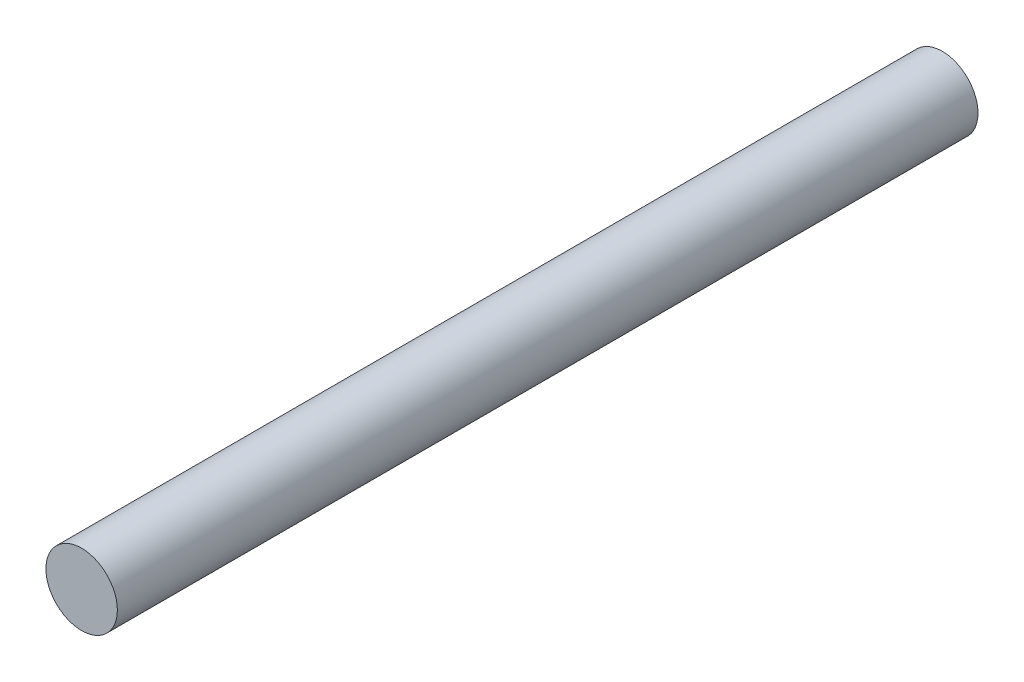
ISO-10303-21;
HEADER;
FILE_DESCRIPTION(('STEP AP214'),'2;1');
FILE_NAME('part.step','',(''),(''),'','','');
FILE_SCHEMA(('AUTOMOTIVE_DESIGN { 1 0 10303 214 1 1 1 1 }'));
ENDSEC;
DATA;
#1=APPLICATION_CONTEXT('core data for automotive mechanical design processes');
#2=APPLICATION_PROTOCOL_DEFINITION('international standard','automotive_design',2000,#1);
#3=PRODUCT_CONTEXT('',#1,'mechanical');
#4=PRODUCT('Part','Part','',(#3));
#5=PRODUCT_RELATED_PRODUCT_CATEGORY('part','',(#4));
#6=PRODUCT_DEFINITION_FORMATION('','',#4);
#7=PRODUCT_DEFINITION_CONTEXT('part definition',#1,'design');
#8=PRODUCT_DEFINITION('design','',#6,#7);
#9=PRODUCT_DEFINITION_SHAPE('','',#8);
#10=(LENGTH_UNIT() NAMED_UNIT(*) SI_UNIT(.MILLI.,.METRE.));
#11=(NAMED_UNIT(*) PLANE_ANGLE_UNIT() SI_UNIT($,.RADIAN.));
#12=(NAMED_UNIT(*) SI_UNIT($,.STERADIAN.) SOLID_ANGLE_UNIT());
#13=UNCERTAINTY_MEASURE_WITH_UNIT(LENGTH_MEASURE(1.E-05),#10,'distance_accuracy_value','');
#14=(GEOMETRIC_REPRESENTATION_CONTEXT(3) GLOBAL_UNCERTAINTY_ASSIGNED_CONTEXT((#13)) GLOBAL_UNIT_ASSIGNED_CONTEXT((#10,
#11,#12)) REPRESENTATION_CONTEXT('',''));
#15=CARTESIAN_POINT('',(0.,0.,0.));
#16=DIRECTION('',(0.,0.,1.));
#17=DIRECTION('',(1.,0.,0.));
#18=AXIS2_PLACEMENT_3D('',#15,#16,#17);
#19=CARTESIAN_POINT('',(0.,0.,48.2));
#20=DIRECTION('',(0.,0.,-1.));
#21=DIRECTION('',(-1.,0.,0.));
#22=AXIS2_PLACEMENT_3D('',#19,#20,#21);
#23=CYLINDRICAL_SURFACE('',#22,2.);
#24=CARTESIAN_POINT('',(0.,0.,48.2));
#25=DIRECTION('',(0.,0.,1.));
#26=DIRECTION('',(1.,0.,0.));
#27=AXIS2_PLACEMENT_3D('',#24,#25,#26);
#28=CIRCLE('',#27,2.);
#29=CARTESIAN_POINT('',(2.,0.,48.2));
#30=VERTEX_POINT('',#29);
#31=EDGE_CURVE('E8',#30,#30,#28,.T.);
#32=ORIENTED_EDGE('',*,*,#31,.F.);
#33=EDGE_LOOP('',(#32));
#34=FACE_BOUND('',#33,.T.);
#35=CARTESIAN_POINT('',(0.,0.,0.));
#36=DIRECTION('',(0.,0.,1.));
#37=DIRECTION('',(1.,0.,0.));
#38=AXIS2_PLACEMENT_3D('',#35,#36,#37);
#39=CIRCLE('',#38,2.);
#40=CARTESIAN_POINT('',(2.,0.,0.));
#41=VERTEX_POINT('',#40);
#42=EDGE_CURVE('E15',#41,#41,#39,.T.);
#43=ORIENTED_EDGE('',*,*,#42,.T.);
#44=EDGE_LOOP('',(#43));
#45=FACE_BOUND('',#44,.T.);
#46=ADVANCED_FACE('F12',(#34,#45),#23,.T.);
#47=CARTESIAN_POINT('',(0.,0.,48.2));
#48=DIRECTION('',(0.,0.,1.));
#49=DIRECTION('',(1.,0.,0.));
#50=AXIS2_PLACEMENT_3D('',#47,#48,#49);
#51=PLANE('',#50);
#52=ORIENTED_EDGE('',*,*,#31,.T.);
#53=EDGE_LOOP('',(#52));
#54=FACE_BOUND('',#53,.T.);
#55=ADVANCED_FACE('F27',(#54),#51,.T.);
#56=CARTESIAN_POINT('',(0.,0.,0.));
#57=DIRECTION('',(0.,0.,1.));
#58=DIRECTION('',(1.,0.,0.));
#59=AXIS2_PLACEMENT_3D('',#56,#57,#58);
#60=PLANE('',#59);
#61=ORIENTED_EDGE('',*,*,#42,.F.);
#62=EDGE_LOOP('',(#61));
#63=FACE_BOUND('',#62,.T.);
#64=ADVANCED_FACE('F25',(#63),#60,.F.);
#65=CLOSED_SHELL('',(#46,#55,#64));
#66=MANIFOLD_SOLID_BREP('B1',#65);
#67=ADVANCED_BREP_SHAPE_REPRESENTATION('',(#18,#66),#14);
#68=SHAPE_DEFINITION_REPRESENTATION(#9,#67);
ENDSEC;
END-ISO-10303-21;
